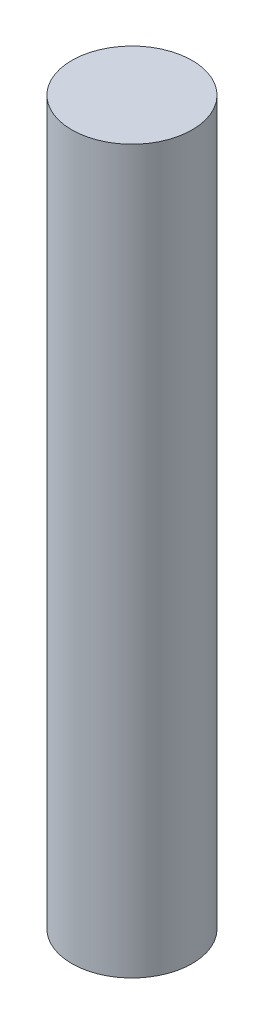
ISO-10303-21;
HEADER;
FILE_DESCRIPTION(('STEP AP214'),'2;1');
FILE_NAME('part.step','',(''),(''),'','','');
FILE_SCHEMA(('AUTOMOTIVE_DESIGN { 1 0 10303 214 1 1 1 1 }'));
ENDSEC;
DATA;
#1=APPLICATION_CONTEXT('core data for automotive mechanical design processes');
#2=APPLICATION_PROTOCOL_DEFINITION('international standard','automotive_design',2000,#1);
#3=PRODUCT_CONTEXT('',#1,'mechanical');
#4=PRODUCT('Part','Part','',(#3));
#5=PRODUCT_RELATED_PRODUCT_CATEGORY('part','',(#4));
#6=PRODUCT_DEFINITION_FORMATION('','',#4);
#7=PRODUCT_DEFINITION_CONTEXT('part definition',#1,'design');
#8=PRODUCT_DEFINITION('design','',#6,#7);
#9=PRODUCT_DEFINITION_SHAPE('','',#8);
#10=(LENGTH_UNIT() NAMED_UNIT(*) SI_UNIT(.MILLI.,.METRE.));
#11=(NAMED_UNIT(*) PLANE_ANGLE_UNIT() SI_UNIT($,.RADIAN.));
#12=(NAMED_UNIT(*) SI_UNIT($,.STERADIAN.) SOLID_ANGLE_UNIT());
#13=UNCERTAINTY_MEASURE_WITH_UNIT(LENGTH_MEASURE(1.E-05),#10,'distance_accuracy_value','');
#14=(GEOMETRIC_REPRESENTATION_CONTEXT(3) GLOBAL_UNCERTAINTY_ASSIGNED_CONTEXT((#13)) GLOBAL_UNIT_ASSIGNED_CONTEXT((#10,
#11,#12)) REPRESENTATION_CONTEXT('',''));
#15=CARTESIAN_POINT('',(0.,0.,0.));
#16=DIRECTION('',(0.,0.,1.));
#17=DIRECTION('',(1.,0.,0.));
#18=AXIS2_PLACEMENT_3D('',#15,#16,#17);
#19=CARTESIAN_POINT('',(0.,-300.,0.));
#20=DIRECTION('',(0.,1.,0.));
#21=DIRECTION('',(0.,0.,1.));
#22=AXIS2_PLACEMENT_3D('',#19,#20,#21);
#23=CYLINDRICAL_SURFACE('',#22,25.);
#24=CARTESIAN_POINT('',(0.,-300.,0.));
#25=DIRECTION('',(0.,1.,0.));
#26=DIRECTION('',(0.,0.,1.));
#27=AXIS2_PLACEMENT_3D('',#24,#25,#26);
#28=CIRCLE('',#27,25.);
#29=CARTESIAN_POINT('',(0.,-300.,25.));
#30=VERTEX_POINT('',#29);
#31=EDGE_CURVE('E10',#30,#30,#28,.T.);
#32=ORIENTED_EDGE('',*,*,#31,.T.);
#33=EDGE_LOOP('',(#32));
#34=FACE_BOUND('',#33,.T.);
#35=CARTESIAN_POINT('',(0.,0.,0.));
#36=DIRECTION('',(0.,1.,0.));
#37=DIRECTION('',(0.,0.,1.));
#38=AXIS2_PLACEMENT_3D('',#35,#36,#37);
#39=CIRCLE('',#38,25.);
#40=CARTESIAN_POINT('',(0.,0.,25.));
#41=VERTEX_POINT('',#40);
#42=EDGE_CURVE('E17',#41,#41,#39,.T.);
#43=ORIENTED_EDGE('',*,*,#42,.F.);
#44=EDGE_LOOP('',(#43));
#45=FACE_BOUND('',#44,.T.);
#46=ADVANCED_FACE('F14',(#34,#45),#23,.T.);
#47=CARTESIAN_POINT('',(0.,-300.,0.));
#48=DIRECTION('',(0.,1.,0.));
#49=DIRECTION('',(0.,0.,1.));
#50=AXIS2_PLACEMENT_3D('',#47,#48,#49);
#51=PLANE('',#50);
#52=ORIENTED_EDGE('',*,*,#31,.F.);
#53=EDGE_LOOP('',(#52));
#54=FACE_BOUND('',#53,.T.);
#55=ADVANCED_FACE('F29',(#54),#51,.F.);
#56=CARTESIAN_POINT('',(0.,0.,0.));
#57=DIRECTION('',(0.,1.,0.));
#58=DIRECTION('',(0.,0.,1.));
#59=AXIS2_PLACEMENT_3D('',#56,#57,#58);
#60=PLANE('',#59);
#61=ORIENTED_EDGE('',*,*,#42,.T.);
#62=EDGE_LOOP('',(#61));
#63=FACE_BOUND('',#62,.T.);
#64=ADVANCED_FACE('F26',(#63),#60,.T.);
#65=CLOSED_SHELL('',(#46,#55,#64));
#66=MANIFOLD_SOLID_BREP('B1',#65);
#67=ADVANCED_BREP_SHAPE_REPRESENTATION('',(#18,#66),#14);
#68=SHAPE_DEFINITION_REPRESENTATION(#9,#67);
ENDSEC;
END-ISO-10303-21;
